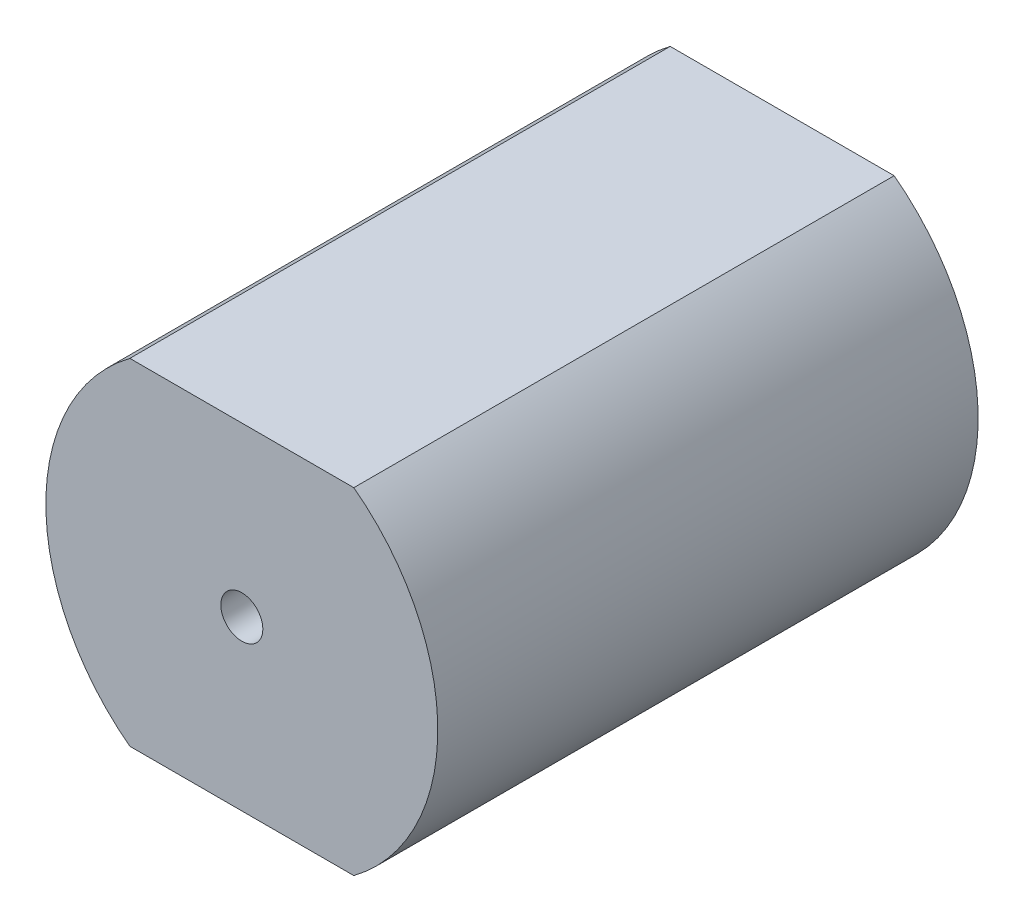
ISO-10303-21;
HEADER;
FILE_DESCRIPTION(('STEP AP214'),'2;1');
FILE_NAME('part.step','',(''),(''),'','','');
FILE_SCHEMA(('AUTOMOTIVE_DESIGN { 1 0 10303 214 1 1 1 1 }'));
ENDSEC;
DATA;
#1=APPLICATION_CONTEXT('core data for automotive mechanical design processes');
#2=APPLICATION_PROTOCOL_DEFINITION('international standard','automotive_design',2000,#1);
#3=PRODUCT_CONTEXT('',#1,'mechanical');
#4=PRODUCT('Part','Part','',(#3));
#5=PRODUCT_RELATED_PRODUCT_CATEGORY('part','',(#4));
#6=PRODUCT_DEFINITION_FORMATION('','',#4);
#7=PRODUCT_DEFINITION_CONTEXT('part definition',#1,'design');
#8=PRODUCT_DEFINITION('design','',#6,#7);
#9=PRODUCT_DEFINITION_SHAPE('','',#8);
#10=(LENGTH_UNIT() NAMED_UNIT(*) SI_UNIT(.MILLI.,.METRE.));
#11=(NAMED_UNIT(*) PLANE_ANGLE_UNIT() SI_UNIT($,.RADIAN.));
#12=(NAMED_UNIT(*) SI_UNIT($,.STERADIAN.) SOLID_ANGLE_UNIT());
#13=UNCERTAINTY_MEASURE_WITH_UNIT(LENGTH_MEASURE(1.E-05),#10,'distance_accuracy_value','');
#14=(GEOMETRIC_REPRESENTATION_CONTEXT(3) GLOBAL_UNCERTAINTY_ASSIGNED_CONTEXT((#13)) GLOBAL_UNIT_ASSIGNED_CONTEXT((#10,
#11,#12)) REPRESENTATION_CONTEXT('',''));
#15=CARTESIAN_POINT('',(0.,0.,0.));
#16=DIRECTION('',(0.,0.,1.));
#17=DIRECTION('',(1.,0.,0.));
#18=AXIS2_PLACEMENT_3D('',#15,#16,#17);
#19=CARTESIAN_POINT('',(-0.5,0.,19.3));
#20=DIRECTION('',(0.,0.,-1.));
#21=DIRECTION('',(-1.,0.,0.));
#22=AXIS2_PLACEMENT_3D('',#19,#20,#21);
#23=CYLINDRICAL_SURFACE('',#22,7.5);
#24=CARTESIAN_POINT('',(-0.5,0.,0.));
#25=DIRECTION('',(0.,0.,1.));
#26=DIRECTION('',(-1.,0.,0.));
#27=AXIS2_PLACEMENT_3D('',#24,#25,#26);
#28=CIRCLE('',#27,7.5);
#29=CARTESIAN_POINT('',(4.,-6.,0.));
#30=VERTEX_POINT('',#29);
#31=CARTESIAN_POINT('',(4.,6.,0.));
#32=VERTEX_POINT('',#31);
#33=EDGE_CURVE('E109',#30,#32,#28,.T.);
#34=ORIENTED_EDGE('',*,*,#33,.T.);
#35=DIRECTION('',(0.,0.,-1.));
#36=VECTOR('',#35,1.);
#37=CARTESIAN_POINT('',(4.,6.,19.3));
#38=LINE('',#37,#36);
#39=CARTESIAN_POINT('',(4.,6.,19.3));
#40=VERTEX_POINT('',#39);
#41=EDGE_CURVE('E13',#40,#32,#38,.T.);
#42=ORIENTED_EDGE('',*,*,#41,.F.);
#43=CARTESIAN_POINT('',(-0.5,0.,19.3));
#44=DIRECTION('',(0.,0.,1.));
#45=DIRECTION('',(-1.,0.,0.));
#46=AXIS2_PLACEMENT_3D('',#43,#44,#45);
#47=CIRCLE('',#46,7.5);
#48=CARTESIAN_POINT('',(4.,-6.,19.3));
#49=VERTEX_POINT('',#48);
#50=EDGE_CURVE('E97',#49,#40,#47,.T.);
#51=ORIENTED_EDGE('',*,*,#50,.F.);
#52=DIRECTION('',(0.,0.,-1.));
#53=VECTOR('',#52,1.);
#54=CARTESIAN_POINT('',(4.,-6.,19.3));
#55=LINE('',#54,#53);
#56=EDGE_CURVE('E105',#49,#30,#55,.T.);
#57=ORIENTED_EDGE('',*,*,#56,.T.);
#58=EDGE_LOOP('',(#34,#42,#51,#57));
#59=FACE_BOUND('',#58,.T.);
#60=ADVANCED_FACE('F46',(#59),#23,.T.);
#61=CARTESIAN_POINT('',(4.,6.,19.3));
#62=DIRECTION('',(0.,-1.,0.));
#63=DIRECTION('',(1.,0.,0.));
#64=AXIS2_PLACEMENT_3D('',#61,#62,#63);
#65=PLANE('',#64);
#66=DIRECTION('',(-1.,0.,0.));
#67=VECTOR('',#66,1.);
#68=CARTESIAN_POINT('',(4.,6.,0.));
#69=LINE('',#68,#67);
#70=CARTESIAN_POINT('',(-4.,6.,0.));
#71=VERTEX_POINT('',#70);
#72=EDGE_CURVE('E101',#32,#71,#69,.T.);
#73=ORIENTED_EDGE('',*,*,#72,.T.);
#74=DIRECTION('',(0.,0.,-1.));
#75=VECTOR('',#74,1.);
#76=CARTESIAN_POINT('',(-4.,6.,19.3));
#77=LINE('',#76,#75);
#78=CARTESIAN_POINT('',(-4.,6.,19.3));
#79=VERTEX_POINT('',#78);
#80=EDGE_CURVE('E54',#79,#71,#77,.T.);
#81=ORIENTED_EDGE('',*,*,#80,.F.);
#82=DIRECTION('',(-1.,0.,0.));
#83=VECTOR('',#82,1.);
#84=CARTESIAN_POINT('',(4.,6.,19.3));
#85=LINE('',#84,#83);
#86=EDGE_CURVE('E92',#40,#79,#85,.T.);
#87=ORIENTED_EDGE('',*,*,#86,.F.);
#88=ORIENTED_EDGE('',*,*,#41,.T.);
#89=EDGE_LOOP('',(#73,#81,#87,#88));
#90=FACE_BOUND('',#89,.T.);
#91=ADVANCED_FACE('F100',(#90),#65,.F.);
#92=CARTESIAN_POINT('',(0.5,0.,19.3));
#93=DIRECTION('',(0.,0.,-1.));
#94=DIRECTION('',(-1.,0.,0.));
#95=AXIS2_PLACEMENT_3D('',#92,#93,#94);
#96=CYLINDRICAL_SURFACE('',#95,7.5);
#97=CARTESIAN_POINT('',(0.5,0.,0.));
#98=DIRECTION('',(0.,0.,1.));
#99=DIRECTION('',(1.,0.,0.));
#100=AXIS2_PLACEMENT_3D('',#97,#98,#99);
#101=CIRCLE('',#100,7.5);
#102=CARTESIAN_POINT('',(-4.,-6.,0.));
#103=VERTEX_POINT('',#102);
#104=EDGE_CURVE('E79',#71,#103,#101,.T.);
#105=ORIENTED_EDGE('',*,*,#104,.T.);
#106=DIRECTION('',(0.,0.,-1.));
#107=VECTOR('',#106,1.);
#108=CARTESIAN_POINT('',(-4.,-6.,19.3));
#109=LINE('',#108,#107);
#110=CARTESIAN_POINT('',(-4.,-6.,19.3));
#111=VERTEX_POINT('',#110);
#112=EDGE_CURVE('E102',#111,#103,#109,.T.);
#113=ORIENTED_EDGE('',*,*,#112,.F.);
#114=CARTESIAN_POINT('',(0.5,0.,19.3));
#115=DIRECTION('',(0.,0.,1.));
#116=DIRECTION('',(1.,0.,0.));
#117=AXIS2_PLACEMENT_3D('',#114,#115,#116);
#118=CIRCLE('',#117,7.5);
#119=EDGE_CURVE('E95',#79,#111,#118,.T.);
#120=ORIENTED_EDGE('',*,*,#119,.F.);
#121=ORIENTED_EDGE('',*,*,#80,.T.);
#122=EDGE_LOOP('',(#105,#113,#120,#121));
#123=FACE_BOUND('',#122,.T.);
#124=ADVANCED_FACE('F103',(#123),#96,.T.);
#125=CARTESIAN_POINT('',(4.,-6.,19.3));
#126=DIRECTION('',(0.,1.,0.));
#127=DIRECTION('',(-1.,0.,0.));
#128=AXIS2_PLACEMENT_3D('',#125,#126,#127);
#129=PLANE('',#128);
#130=DIRECTION('',(1.,0.,0.));
#131=VECTOR('',#130,1.);
#132=CARTESIAN_POINT('',(4.,-6.,0.));
#133=LINE('',#132,#131);
#134=EDGE_CURVE('E85',#103,#30,#133,.T.);
#135=ORIENTED_EDGE('',*,*,#134,.T.);
#136=ORIENTED_EDGE('',*,*,#56,.F.);
#137=DIRECTION('',(1.,0.,0.));
#138=VECTOR('',#137,1.);
#139=CARTESIAN_POINT('',(4.,-6.,19.3));
#140=LINE('',#139,#138);
#141=EDGE_CURVE('E62',#111,#49,#140,.T.);
#142=ORIENTED_EDGE('',*,*,#141,.F.);
#143=ORIENTED_EDGE('',*,*,#112,.T.);
#144=EDGE_LOOP('',(#135,#136,#142,#143));
#145=FACE_BOUND('',#144,.T.);
#146=ADVANCED_FACE('F117',(#145),#129,.F.);
#147=CARTESIAN_POINT('',(-0.5,0.,19.3));
#148=DIRECTION('',(0.,0.,-1.));
#149=DIRECTION('',(-1.,0.,0.));
#150=AXIS2_PLACEMENT_3D('',#147,#148,#149);
#151=PLANE('',#150);
#152=CARTESIAN_POINT('',(0.,0.,19.3));
#153=DIRECTION('',(0.,0.,1.));
#154=DIRECTION('',(1.,0.,0.));
#155=AXIS2_PLACEMENT_3D('',#152,#153,#154);
#156=CIRCLE('',#155,0.75);
#157=CARTESIAN_POINT('',(0.75,0.,19.3));
#158=VERTEX_POINT('',#157);
#159=EDGE_CURVE('E123',#158,#158,#156,.T.);
#160=ORIENTED_EDGE('',*,*,#159,.F.);
#161=EDGE_LOOP('',(#160));
#162=FACE_BOUND('',#161,.T.);
#163=ORIENTED_EDGE('',*,*,#50,.T.);
#164=ORIENTED_EDGE('',*,*,#86,.T.);
#165=ORIENTED_EDGE('',*,*,#119,.T.);
#166=ORIENTED_EDGE('',*,*,#141,.T.);
#167=EDGE_LOOP('',(#163,#164,#165,#166));
#168=FACE_BOUND('',#167,.T.);
#169=ADVANCED_FACE('F93',(#162,#168),#151,.F.);
#170=CARTESIAN_POINT('',(-0.5,0.,0.));
#171=DIRECTION('',(0.,0.,-1.));
#172=DIRECTION('',(-1.,0.,0.));
#173=AXIS2_PLACEMENT_3D('',#170,#171,#172);
#174=PLANE('',#173);
#175=ORIENTED_EDGE('',*,*,#33,.F.);
#176=ORIENTED_EDGE('',*,*,#134,.F.);
#177=ORIENTED_EDGE('',*,*,#104,.F.);
#178=ORIENTED_EDGE('',*,*,#72,.F.);
#179=EDGE_LOOP('',(#175,#176,#177,#178));
#180=FACE_BOUND('',#179,.T.);
#181=ADVANCED_FACE('F120',(#180),#174,.T.);
#182=CARTESIAN_POINT('',(0.,0.,17.3));
#183=DIRECTION('',(0.,0.,1.));
#184=DIRECTION('',(1.,0.,0.));
#185=AXIS2_PLACEMENT_3D('',#182,#183,#184);
#186=CYLINDRICAL_SURFACE('',#185,0.75);
#187=CARTESIAN_POINT('',(0.,0.,17.3));
#188=DIRECTION('',(0.,0.,1.));
#189=DIRECTION('',(1.,0.,0.));
#190=AXIS2_PLACEMENT_3D('',#187,#188,#189);
#191=CIRCLE('',#190,0.75);
#192=CARTESIAN_POINT('',(0.75,0.,17.3));
#193=VERTEX_POINT('',#192);
#194=EDGE_CURVE('E112',#193,#193,#191,.T.);
#195=ORIENTED_EDGE('',*,*,#194,.F.);
#196=EDGE_LOOP('',(#195));
#197=FACE_BOUND('',#196,.T.);
#198=ORIENTED_EDGE('',*,*,#159,.T.);
#199=EDGE_LOOP('',(#198));
#200=FACE_BOUND('',#199,.T.);
#201=ADVANCED_FACE('F131',(#197,#200),#186,.F.);
#202=CARTESIAN_POINT('',(0.,0.,17.3));
#203=DIRECTION('',(0.,0.,1.));
#204=DIRECTION('',(1.,0.,0.));
#205=AXIS2_PLACEMENT_3D('',#202,#203,#204);
#206=PLANE('',#205);
#207=ORIENTED_EDGE('',*,*,#194,.T.);
#208=EDGE_LOOP('',(#207));
#209=FACE_BOUND('',#208,.T.);
#210=ADVANCED_FACE('F129',(#209),#206,.T.);
#211=CLOSED_SHELL('',(#60,#91,#124,#146,#169,#181,#201,#210));
#212=MANIFOLD_SOLID_BREP('B2',#211);
#213=ADVANCED_BREP_SHAPE_REPRESENTATION('',(#18,#212),#14);
#214=SHAPE_DEFINITION_REPRESENTATION(#9,#213);
ENDSEC;
END-ISO-10303-21;
